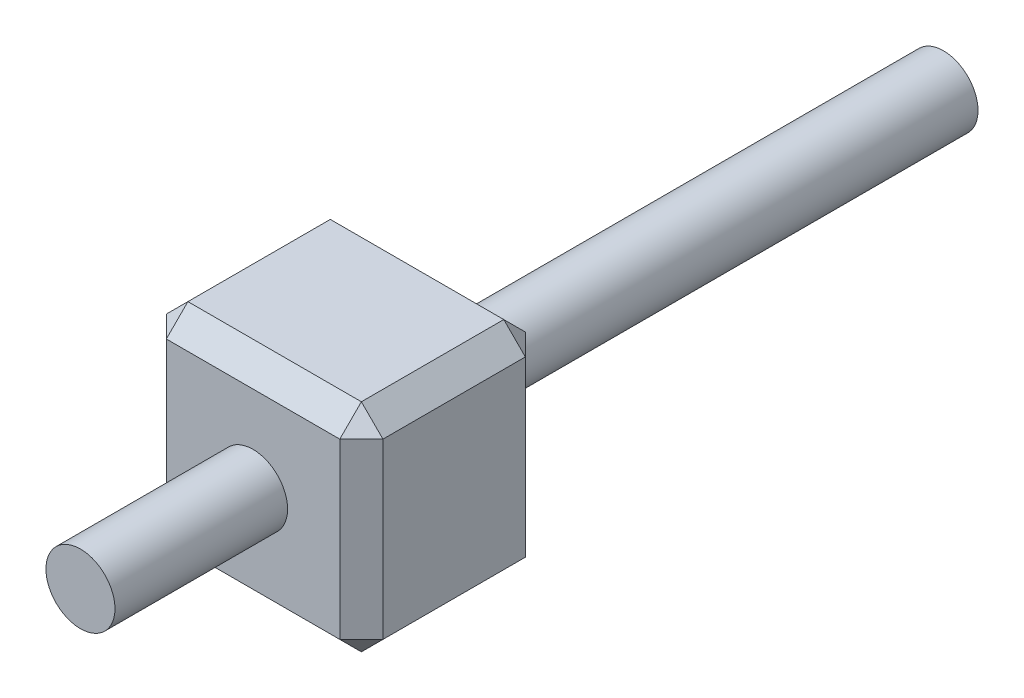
from build123d import *

# Parameters (mm, degrees)
ESQUISSE1_W           = 2.51
ESQUISSE1_H           = 2.51
EXTRUSION1_DEPTH      = 2.15
EXTRUSION2_DEPTH      = 2
EXTRUSION2_DEPTH_BACK = 8
ESQUISSE2_R           = 0.4
CHANFREIN1_SIZE       = 0.25


with BuildPart() as part:
    # Esquisse1 → Extrusion1 (new body)
    with BuildSketch(Plane.XY):
        with Locations((-29.245415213, 23.064714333)):
            Rectangle(ESQUISSE1_W, ESQUISSE1_H)
    extrude(amount=EXTRUSION1_DEPTH)

    # Esquisse2 → Extrusion2 (add, two sides: drawn at the far end of the back side and taken through both)
    with BuildSketch(Plane.XY.offset(2.15).offset(-EXTRUSION2_DEPTH_BACK)):
        with Locations((-29.245415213, 23.064714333)):
            Circle(ESQUISSE2_R)
    extrude(amount=EXTRUSION2_DEPTH + EXTRUSION2_DEPTH_BACK)

    # Chanfrein1
    chanfrein1_edges = [part.edges().sort_by_distance(p)[0] for p in [
        (-27.990415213, 23.064714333, 2.15),
        (-29.245415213, 24.319714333, 2.15),
        (-30.500415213, 23.064714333, 2.15),
        (-29.245415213, 24.319714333, 0),
        (-27.990415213, 23.064714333, 0),
        (-29.245415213, 21.809714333, 0),
        (-30.500415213, 23.064714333, 0),
        (-29.245415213, 21.809714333, 2.15),
        (-30.500415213, 24.319714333, 1.075),
        (-27.990415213, 24.319714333, 1.075),
        (-27.990415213, 21.809714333, 1.075),
        (-30.500415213, 21.809714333, 1.075),
    ]]
    chamfer(chanfrein1_edges, length=CHANFREIN1_SIZE)


solid = part.part
